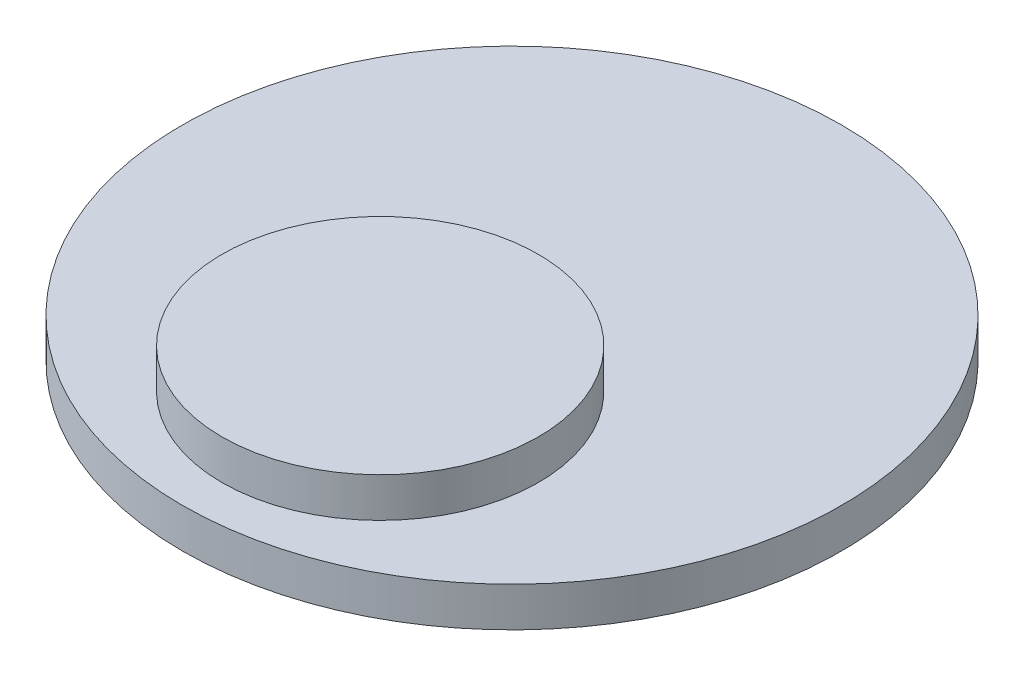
from build123d import *

# Parameters (mm, degrees)
SKETCH1_R           = 12.5
BOSS_EXTRUDE1_DEPTH = 1.5
SKETCH2_R           = 6
BOSS_EXTRUDE2_DEPTH = 1.5


with BuildPart() as part:
    # Sketch1 → Boss-Extrude1 (new body)
    with BuildSketch(Plane(origin=(0, 0, 0), x_dir=(1, 0, 0), z_dir=(0, 1, 0))):
        with Locations(Location((0, 0, 0), (0, 0, 270))):
            Circle(SKETCH1_R)
    extrude(amount=BOSS_EXTRUDE1_DEPTH)

    # Sketch2 → Boss-Extrude2 (add)
    with BuildSketch(Plane(origin=(0, 1.5, 0), x_dir=(1, 0, 0), z_dir=(0, 1, 0))):
        with Locations(Location((0, -5, 0), (0, 0, 270))):
            Circle(SKETCH2_R)
    extrude(amount=BOSS_EXTRUDE2_DEPTH)


solid = part.part
